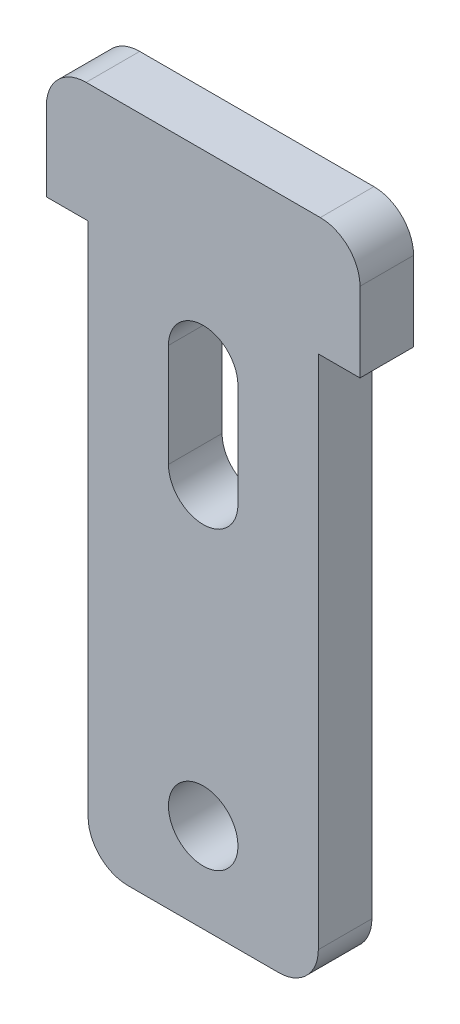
ISO-10303-21;
HEADER;
FILE_DESCRIPTION(('STEP AP214'),'2;1');
FILE_NAME('part.step','',(''),(''),'','','');
FILE_SCHEMA(('AUTOMOTIVE_DESIGN { 1 0 10303 214 1 1 1 1 }'));
ENDSEC;
DATA;
#1=APPLICATION_CONTEXT('core data for automotive mechanical design processes');
#2=APPLICATION_PROTOCOL_DEFINITION('international standard','automotive_design',2000,#1);
#3=PRODUCT_CONTEXT('',#1,'mechanical');
#4=PRODUCT('Part','Part','',(#3));
#5=PRODUCT_RELATED_PRODUCT_CATEGORY('part','',(#4));
#6=PRODUCT_DEFINITION_FORMATION('','',#4);
#7=PRODUCT_DEFINITION_CONTEXT('part definition',#1,'design');
#8=PRODUCT_DEFINITION('design','',#6,#7);
#9=PRODUCT_DEFINITION_SHAPE('','',#8);
#10=(LENGTH_UNIT() NAMED_UNIT(*) SI_UNIT(.MILLI.,.METRE.));
#11=(NAMED_UNIT(*) PLANE_ANGLE_UNIT() SI_UNIT($,.RADIAN.));
#12=(NAMED_UNIT(*) SI_UNIT($,.STERADIAN.) SOLID_ANGLE_UNIT());
#13=UNCERTAINTY_MEASURE_WITH_UNIT(LENGTH_MEASURE(1.E-05),#10,'distance_accuracy_value','');
#14=(GEOMETRIC_REPRESENTATION_CONTEXT(3) GLOBAL_UNCERTAINTY_ASSIGNED_CONTEXT((#13)) GLOBAL_UNIT_ASSIGNED_CONTEXT((#10,
#11,#12)) REPRESENTATION_CONTEXT('',''));
#15=CARTESIAN_POINT('',(0.,0.,0.));
#16=DIRECTION('',(0.,0.,1.));
#17=DIRECTION('',(1.,0.,0.));
#18=AXIS2_PLACEMENT_3D('',#15,#16,#17);
#19=CARTESIAN_POINT('',(5.9,4.,2.7));
#20=DIRECTION('',(0.,0.,-1.));
#21=DIRECTION('',(-1.,0.,0.));
#22=AXIS2_PLACEMENT_3D('',#19,#20,#21);
#23=PLANE('',#22);
#24=CARTESIAN_POINT('',(0.,-23.5,2.7));
#25=DIRECTION('',(0.,0.,1.));
#26=DIRECTION('',(1.,0.,0.));
#27=AXIS2_PLACEMENT_3D('',#24,#25,#26);
#28=CIRCLE('',#27,1.75);
#29=CARTESIAN_POINT('',(-1.75,-23.5,2.7));
#30=VERTEX_POINT('',#29);
#31=EDGE_CURVE('E194',#30,#30,#28,.T.);
#32=ORIENTED_EDGE('',*,*,#31,.F.);
#33=EDGE_LOOP('',(#32));
#34=FACE_BOUND('',#33,.T.);
#35=DIRECTION('',(1.,0.,0.));
#36=VECTOR('',#35,1.);
#37=CARTESIAN_POINT('',(5.8,0.,2.7));
#38=LINE('',#37,#36);
#39=CARTESIAN_POINT('',(5.8,0.,2.7));
#40=VERTEX_POINT('',#39);
#41=CARTESIAN_POINT('',(7.9,0.,2.7));
#42=VERTEX_POINT('',#41);
#43=EDGE_CURVE('E200',#40,#42,#38,.T.);
#44=ORIENTED_EDGE('',*,*,#43,.T.);
#45=DIRECTION('',(0.,1.,0.));
#46=VECTOR('',#45,1.);
#47=CARTESIAN_POINT('',(7.9,0.,2.7));
#48=LINE('',#47,#46);
#49=CARTESIAN_POINT('',(7.9,3.99999999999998,2.7));
#50=VERTEX_POINT('',#49);
#51=EDGE_CURVE('E203',#42,#50,#48,.T.);
#52=ORIENTED_EDGE('',*,*,#51,.T.);
#53=CARTESIAN_POINT('',(5.9,4.,2.7));
#54=DIRECTION('',(0.,0.,1.));
#55=DIRECTION('',(-1.,0.,0.));
#56=AXIS2_PLACEMENT_3D('',#53,#54,#55);
#57=CIRCLE('',#56,2.);
#58=CARTESIAN_POINT('',(5.89999999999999,6.,2.7));
#59=VERTEX_POINT('',#58);
#60=EDGE_CURVE('E206',#50,#59,#57,.T.);
#61=ORIENTED_EDGE('',*,*,#60,.T.);
#62=DIRECTION('',(-1.,0.,0.));
#63=VECTOR('',#62,1.);
#64=CARTESIAN_POINT('',(-5.89999999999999,6.,2.7));
#65=LINE('',#64,#63);
#66=CARTESIAN_POINT('',(-5.89999999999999,6.,2.7));
#67=VERTEX_POINT('',#66);
#68=EDGE_CURVE('E208',#59,#67,#65,.T.);
#69=ORIENTED_EDGE('',*,*,#68,.T.);
#70=CARTESIAN_POINT('',(-5.9,4.,2.7));
#71=DIRECTION('',(0.,0.,1.));
#72=DIRECTION('',(-1.,0.,0.));
#73=AXIS2_PLACEMENT_3D('',#70,#71,#72);
#74=CIRCLE('',#73,2.);
#75=CARTESIAN_POINT('',(-7.9,3.99999999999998,2.7));
#76=VERTEX_POINT('',#75);
#77=EDGE_CURVE('E210',#67,#76,#74,.T.);
#78=ORIENTED_EDGE('',*,*,#77,.T.);
#79=DIRECTION('',(0.,-1.,0.));
#80=VECTOR('',#79,1.);
#81=CARTESIAN_POINT('',(-7.9,0.,2.7));
#82=LINE('',#81,#80);
#83=CARTESIAN_POINT('',(-7.9,0.,2.7));
#84=VERTEX_POINT('',#83);
#85=EDGE_CURVE('E212',#76,#84,#82,.T.);
#86=ORIENTED_EDGE('',*,*,#85,.T.);
#87=DIRECTION('',(1.,0.,0.));
#88=VECTOR('',#87,1.);
#89=CARTESIAN_POINT('',(-7.9,0.,2.7));
#90=LINE('',#89,#88);
#91=CARTESIAN_POINT('',(-5.8,0.,2.7));
#92=VERTEX_POINT('',#91);
#93=EDGE_CURVE('E214',#84,#92,#90,.T.);
#94=ORIENTED_EDGE('',*,*,#93,.T.);
#95=DIRECTION('',(0.,-1.,0.));
#96=VECTOR('',#95,1.);
#97=CARTESIAN_POINT('',(-5.8,0.,2.7));
#98=LINE('',#97,#96);
#99=CARTESIAN_POINT('',(-5.8,-26.,2.7));
#100=VERTEX_POINT('',#99);
#101=EDGE_CURVE('E216',#92,#100,#98,.T.);
#102=ORIENTED_EDGE('',*,*,#101,.T.);
#103=CARTESIAN_POINT('',(-3.8,-26.,2.7));
#104=DIRECTION('',(0.,0.,1.));
#105=DIRECTION('',(1.,0.,0.));
#106=AXIS2_PLACEMENT_3D('',#103,#104,#105);
#107=CIRCLE('',#106,2.);
#108=CARTESIAN_POINT('',(-3.79999999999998,-28.,2.7));
#109=VERTEX_POINT('',#108);
#110=EDGE_CURVE('E218',#100,#109,#107,.T.);
#111=ORIENTED_EDGE('',*,*,#110,.T.);
#112=DIRECTION('',(1.,0.,0.));
#113=VECTOR('',#112,1.);
#114=CARTESIAN_POINT('',(-3.79999999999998,-28.,2.7));
#115=LINE('',#114,#113);
#116=CARTESIAN_POINT('',(3.79999999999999,-28.,2.7));
#117=VERTEX_POINT('',#116);
#118=EDGE_CURVE('E220',#109,#117,#115,.T.);
#119=ORIENTED_EDGE('',*,*,#118,.T.);
#120=CARTESIAN_POINT('',(3.8,-26.,2.7));
#121=DIRECTION('',(0.,0.,1.));
#122=DIRECTION('',(1.,0.,0.));
#123=AXIS2_PLACEMENT_3D('',#120,#121,#122);
#124=CIRCLE('',#123,2.);
#125=CARTESIAN_POINT('',(5.8,-26.,2.7));
#126=VERTEX_POINT('',#125);
#127=EDGE_CURVE('E222',#117,#126,#124,.T.);
#128=ORIENTED_EDGE('',*,*,#127,.T.);
#129=DIRECTION('',(0.,1.,0.));
#130=VECTOR('',#129,1.);
#131=CARTESIAN_POINT('',(5.8,-26.,2.7));
#132=LINE('',#131,#130);
#133=EDGE_CURVE('E224',#126,#40,#132,.T.);
#134=ORIENTED_EDGE('',*,*,#133,.T.);
#135=EDGE_LOOP('',(#44,#52,#61,#69,#78,#86,#94,#102,#111,#119,#128,#134));
#136=FACE_BOUND('',#135,.T.);
#137=CARTESIAN_POINT('',(0.,-3.40288885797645,2.7));
#138=DIRECTION('',(0.,0.,1.));
#139=DIRECTION('',(1.,0.,0.));
#140=AXIS2_PLACEMENT_3D('',#137,#138,#139);
#141=CIRCLE('',#140,1.75);
#142=CARTESIAN_POINT('',(1.75,-3.40288885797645,2.7));
#143=VERTEX_POINT('',#142);
#144=CARTESIAN_POINT('',(-1.75,-3.40288885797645,2.7));
#145=VERTEX_POINT('',#144);
#146=EDGE_CURVE('E158',#143,#145,#141,.T.);
#147=ORIENTED_EDGE('',*,*,#146,.F.);
#148=DIRECTION('',(0.,1.,0.));
#149=VECTOR('',#148,1.);
#150=CARTESIAN_POINT('',(1.75,-3.40288885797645,2.7));
#151=LINE('',#150,#149);
#152=CARTESIAN_POINT('',(1.75,-8.59711114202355,2.7));
#153=VERTEX_POINT('',#152);
#154=EDGE_CURVE('E180',#153,#143,#151,.T.);
#155=ORIENTED_EDGE('',*,*,#154,.F.);
#156=CARTESIAN_POINT('',(0.,-8.59711114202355,2.7));
#157=DIRECTION('',(0.,0.,1.));
#158=DIRECTION('',(1.,0.,0.));
#159=AXIS2_PLACEMENT_3D('',#156,#157,#158);
#160=CIRCLE('',#159,1.75);
#161=CARTESIAN_POINT('',(-1.75,-8.59711114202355,2.7));
#162=VERTEX_POINT('',#161);
#163=EDGE_CURVE('E178',#162,#153,#160,.T.);
#164=ORIENTED_EDGE('',*,*,#163,.F.);
#165=DIRECTION('',(0.,-1.,0.));
#166=VECTOR('',#165,1.);
#167=CARTESIAN_POINT('',(-1.75,-3.40288885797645,2.7));
#168=LINE('',#167,#166);
#169=EDGE_CURVE('E166',#145,#162,#168,.T.);
#170=ORIENTED_EDGE('',*,*,#169,.F.);
#171=EDGE_LOOP('',(#147,#155,#164,#170));
#172=FACE_BOUND('',#171,.T.);
#173=ADVANCED_FACE('F45',(#34,#136,#172),#23,.F.);
#174=CARTESIAN_POINT('',(5.9,4.,0.));
#175=DIRECTION('',(0.,0.,-1.));
#176=DIRECTION('',(-1.,0.,0.));
#177=AXIS2_PLACEMENT_3D('',#174,#175,#176);
#178=PLANE('',#177);
#179=DIRECTION('',(1.,0.,0.));
#180=VECTOR('',#179,1.);
#181=CARTESIAN_POINT('',(5.8,0.,0.));
#182=LINE('',#181,#180);
#183=CARTESIAN_POINT('',(5.8,0.,0.));
#184=VERTEX_POINT('',#183);
#185=CARTESIAN_POINT('',(7.9,0.,0.));
#186=VERTEX_POINT('',#185);
#187=EDGE_CURVE('E197',#184,#186,#182,.T.);
#188=ORIENTED_EDGE('',*,*,#187,.F.);
#189=DIRECTION('',(0.,1.,0.));
#190=VECTOR('',#189,1.);
#191=CARTESIAN_POINT('',(5.8,-26.,0.));
#192=LINE('',#191,#190);
#193=CARTESIAN_POINT('',(5.8,-26.,0.));
#194=VERTEX_POINT('',#193);
#195=EDGE_CURVE('E204',#194,#184,#192,.T.);
#196=ORIENTED_EDGE('',*,*,#195,.F.);
#197=CARTESIAN_POINT('',(3.8,-26.,0.));
#198=DIRECTION('',(0.,0.,1.));
#199=DIRECTION('',(1.,0.,0.));
#200=AXIS2_PLACEMENT_3D('',#197,#198,#199);
#201=CIRCLE('',#200,2.);
#202=CARTESIAN_POINT('',(3.79999999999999,-28.,0.));
#203=VERTEX_POINT('',#202);
#204=EDGE_CURVE('E247',#203,#194,#201,.T.);
#205=ORIENTED_EDGE('',*,*,#204,.F.);
#206=DIRECTION('',(1.,0.,0.));
#207=VECTOR('',#206,1.);
#208=CARTESIAN_POINT('',(-3.79999999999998,-28.,0.));
#209=LINE('',#208,#207);
#210=CARTESIAN_POINT('',(-3.79999999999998,-28.,0.));
#211=VERTEX_POINT('',#210);
#212=EDGE_CURVE('E245',#211,#203,#209,.T.);
#213=ORIENTED_EDGE('',*,*,#212,.F.);
#214=CARTESIAN_POINT('',(-3.8,-26.,0.));
#215=DIRECTION('',(0.,0.,1.));
#216=DIRECTION('',(1.,0.,0.));
#217=AXIS2_PLACEMENT_3D('',#214,#215,#216);
#218=CIRCLE('',#217,2.);
#219=CARTESIAN_POINT('',(-5.8,-26.,0.));
#220=VERTEX_POINT('',#219);
#221=EDGE_CURVE('E243',#220,#211,#218,.T.);
#222=ORIENTED_EDGE('',*,*,#221,.F.);
#223=DIRECTION('',(0.,-1.,0.));
#224=VECTOR('',#223,1.);
#225=CARTESIAN_POINT('',(-5.8,0.,0.));
#226=LINE('',#225,#224);
#227=CARTESIAN_POINT('',(-5.8,0.,0.));
#228=VERTEX_POINT('',#227);
#229=EDGE_CURVE('E241',#228,#220,#226,.T.);
#230=ORIENTED_EDGE('',*,*,#229,.F.);
#231=DIRECTION('',(1.,0.,0.));
#232=VECTOR('',#231,1.);
#233=CARTESIAN_POINT('',(-7.9,0.,0.));
#234=LINE('',#233,#232);
#235=CARTESIAN_POINT('',(-7.9,0.,0.));
#236=VERTEX_POINT('',#235);
#237=EDGE_CURVE('E239',#236,#228,#234,.T.);
#238=ORIENTED_EDGE('',*,*,#237,.F.);
#239=DIRECTION('',(0.,-1.,0.));
#240=VECTOR('',#239,1.);
#241=CARTESIAN_POINT('',(-7.9,0.,0.));
#242=LINE('',#241,#240);
#243=CARTESIAN_POINT('',(-7.9,3.99999999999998,0.));
#244=VERTEX_POINT('',#243);
#245=EDGE_CURVE('E237',#244,#236,#242,.T.);
#246=ORIENTED_EDGE('',*,*,#245,.F.);
#247=CARTESIAN_POINT('',(-5.9,4.,0.));
#248=DIRECTION('',(0.,0.,1.));
#249=DIRECTION('',(-1.,0.,0.));
#250=AXIS2_PLACEMENT_3D('',#247,#248,#249);
#251=CIRCLE('',#250,2.);
#252=CARTESIAN_POINT('',(-5.89999999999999,6.,0.));
#253=VERTEX_POINT('',#252);
#254=EDGE_CURVE('E235',#253,#244,#251,.T.);
#255=ORIENTED_EDGE('',*,*,#254,.F.);
#256=DIRECTION('',(-1.,0.,0.));
#257=VECTOR('',#256,1.);
#258=CARTESIAN_POINT('',(-5.89999999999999,6.,0.));
#259=LINE('',#258,#257);
#260=CARTESIAN_POINT('',(5.89999999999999,6.,0.));
#261=VERTEX_POINT('',#260);
#262=EDGE_CURVE('E233',#261,#253,#259,.T.);
#263=ORIENTED_EDGE('',*,*,#262,.F.);
#264=CARTESIAN_POINT('',(5.9,4.,0.));
#265=DIRECTION('',(0.,0.,1.));
#266=DIRECTION('',(-1.,0.,0.));
#267=AXIS2_PLACEMENT_3D('',#264,#265,#266);
#268=CIRCLE('',#267,2.);
#269=CARTESIAN_POINT('',(7.9,3.99999999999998,0.));
#270=VERTEX_POINT('',#269);
#271=EDGE_CURVE('E231',#270,#261,#268,.T.);
#272=ORIENTED_EDGE('',*,*,#271,.F.);
#273=DIRECTION('',(0.,1.,0.));
#274=VECTOR('',#273,1.);
#275=CARTESIAN_POINT('',(7.9,0.,0.));
#276=LINE('',#275,#274);
#277=EDGE_CURVE('E229',#186,#270,#276,.T.);
#278=ORIENTED_EDGE('',*,*,#277,.F.);
#279=EDGE_LOOP('',(#188,#196,#205,#213,#222,#230,#238,#246,#255,#263,#272,#278));
#280=FACE_BOUND('',#279,.T.);
#281=CARTESIAN_POINT('',(0.,-23.5,0.));
#282=DIRECTION('',(0.,0.,1.));
#283=DIRECTION('',(1.,0.,0.));
#284=AXIS2_PLACEMENT_3D('',#281,#282,#283);
#285=CIRCLE('',#284,1.75);
#286=CARTESIAN_POINT('',(-1.75,-23.5,0.));
#287=VERTEX_POINT('',#286);
#288=EDGE_CURVE('E174',#287,#287,#285,.T.);
#289=ORIENTED_EDGE('',*,*,#288,.T.);
#290=EDGE_LOOP('',(#289));
#291=FACE_BOUND('',#290,.T.);
#292=DIRECTION('',(0.,1.,0.));
#293=VECTOR('',#292,1.);
#294=CARTESIAN_POINT('',(1.75,-3.40288885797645,0.));
#295=LINE('',#294,#293);
#296=CARTESIAN_POINT('',(1.75,-8.59711114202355,0.));
#297=VERTEX_POINT('',#296);
#298=CARTESIAN_POINT('',(1.75,-3.40288885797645,0.));
#299=VERTEX_POINT('',#298);
#300=EDGE_CURVE('E167',#297,#299,#295,.T.);
#301=ORIENTED_EDGE('',*,*,#300,.T.);
#302=CARTESIAN_POINT('',(0.,-3.40288885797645,0.));
#303=DIRECTION('',(0.,0.,1.));
#304=DIRECTION('',(1.,0.,0.));
#305=AXIS2_PLACEMENT_3D('',#302,#303,#304);
#306=CIRCLE('',#305,1.75);
#307=CARTESIAN_POINT('',(-1.75,-3.40288885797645,0.));
#308=VERTEX_POINT('',#307);
#309=EDGE_CURVE('E68',#299,#308,#306,.T.);
#310=ORIENTED_EDGE('',*,*,#309,.T.);
#311=DIRECTION('',(0.,-1.,0.));
#312=VECTOR('',#311,1.);
#313=CARTESIAN_POINT('',(-1.75,-3.40288885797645,0.));
#314=LINE('',#313,#312);
#315=CARTESIAN_POINT('',(-1.75,-8.59711114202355,0.));
#316=VERTEX_POINT('',#315);
#317=EDGE_CURVE('E173',#308,#316,#314,.T.);
#318=ORIENTED_EDGE('',*,*,#317,.T.);
#319=CARTESIAN_POINT('',(0.,-8.59711114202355,0.));
#320=DIRECTION('',(0.,0.,1.));
#321=DIRECTION('',(1.,0.,0.));
#322=AXIS2_PLACEMENT_3D('',#319,#320,#321);
#323=CIRCLE('',#322,1.75);
#324=EDGE_CURVE('E186',#316,#297,#323,.T.);
#325=ORIENTED_EDGE('',*,*,#324,.T.);
#326=EDGE_LOOP('',(#301,#310,#318,#325));
#327=FACE_BOUND('',#326,.T.);
#328=ADVANCED_FACE('F289',(#280,#291,#327),#178,.T.);
#329=CARTESIAN_POINT('',(5.8,0.,2.7));
#330=DIRECTION('',(0.,1.,0.));
#331=DIRECTION('',(-1.,0.,0.));
#332=AXIS2_PLACEMENT_3D('',#329,#330,#331);
#333=PLANE('',#332);
#334=ORIENTED_EDGE('',*,*,#187,.T.);
#335=DIRECTION('',(0.,0.,-1.));
#336=VECTOR('',#335,1.);
#337=CARTESIAN_POINT('',(7.9,0.,2.7));
#338=LINE('',#337,#336);
#339=EDGE_CURVE('E13',#42,#186,#338,.T.);
#340=ORIENTED_EDGE('',*,*,#339,.F.);
#341=ORIENTED_EDGE('',*,*,#43,.F.);
#342=DIRECTION('',(0.,0.,-1.));
#343=VECTOR('',#342,1.);
#344=CARTESIAN_POINT('',(5.8,0.,2.7));
#345=LINE('',#344,#343);
#346=EDGE_CURVE('E226',#40,#184,#345,.T.);
#347=ORIENTED_EDGE('',*,*,#346,.T.);
#348=EDGE_LOOP('',(#334,#340,#341,#347));
#349=FACE_BOUND('',#348,.T.);
#350=ADVANCED_FACE('F47',(#349),#333,.F.);
#351=CARTESIAN_POINT('',(7.9,0.,2.7));
#352=DIRECTION('',(-1.,0.,0.));
#353=DIRECTION('',(0.,0.,1.));
#354=AXIS2_PLACEMENT_3D('',#351,#352,#353);
#355=PLANE('',#354);
#356=ORIENTED_EDGE('',*,*,#277,.T.);
#357=DIRECTION('',(0.,0.,-1.));
#358=VECTOR('',#357,1.);
#359=CARTESIAN_POINT('',(7.9,3.99999999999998,2.7));
#360=LINE('',#359,#358);
#361=EDGE_CURVE('E53',#50,#270,#360,.T.);
#362=ORIENTED_EDGE('',*,*,#361,.F.);
#363=ORIENTED_EDGE('',*,*,#51,.F.);
#364=ORIENTED_EDGE('',*,*,#339,.T.);
#365=EDGE_LOOP('',(#356,#362,#363,#364));
#366=FACE_BOUND('',#365,.T.);
#367=ADVANCED_FACE('F306',(#366),#355,.F.);
#368=CARTESIAN_POINT('',(5.9,4.,2.7));
#369=DIRECTION('',(0.,0.,-1.));
#370=DIRECTION('',(-1.,0.,0.));
#371=AXIS2_PLACEMENT_3D('',#368,#369,#370);
#372=CYLINDRICAL_SURFACE('',#371,2.);
#373=ORIENTED_EDGE('',*,*,#271,.T.);
#374=DIRECTION('',(0.,0.,-1.));
#375=VECTOR('',#374,1.);
#376=CARTESIAN_POINT('',(5.89999999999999,6.,2.7));
#377=LINE('',#376,#375);
#378=EDGE_CURVE('E276',#59,#261,#377,.T.);
#379=ORIENTED_EDGE('',*,*,#378,.F.);
#380=ORIENTED_EDGE('',*,*,#60,.F.);
#381=ORIENTED_EDGE('',*,*,#361,.T.);
#382=EDGE_LOOP('',(#373,#379,#380,#381));
#383=FACE_BOUND('',#382,.T.);
#384=ADVANCED_FACE('F283',(#383),#372,.T.);
#385=CARTESIAN_POINT('',(-5.89999999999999,6.,2.7));
#386=DIRECTION('',(0.,-1.,0.));
#387=DIRECTION('',(0.,0.,-1.));
#388=AXIS2_PLACEMENT_3D('',#385,#386,#387);
#389=PLANE('',#388);
#390=ORIENTED_EDGE('',*,*,#262,.T.);
#391=DIRECTION('',(0.,0.,-1.));
#392=VECTOR('',#391,1.);
#393=CARTESIAN_POINT('',(-5.89999999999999,6.,2.7));
#394=LINE('',#393,#392);
#395=EDGE_CURVE('E273',#67,#253,#394,.T.);
#396=ORIENTED_EDGE('',*,*,#395,.F.);
#397=ORIENTED_EDGE('',*,*,#68,.F.);
#398=ORIENTED_EDGE('',*,*,#378,.T.);
#399=EDGE_LOOP('',(#390,#396,#397,#398));
#400=FACE_BOUND('',#399,.T.);
#401=ADVANCED_FACE('F295',(#400),#389,.F.);
#402=CARTESIAN_POINT('',(-5.9,4.,2.7));
#403=DIRECTION('',(0.,0.,-1.));
#404=DIRECTION('',(-1.,0.,0.));
#405=AXIS2_PLACEMENT_3D('',#402,#403,#404);
#406=CYLINDRICAL_SURFACE('',#405,2.);
#407=ORIENTED_EDGE('',*,*,#254,.T.);
#408=DIRECTION('',(0.,0.,-1.));
#409=VECTOR('',#408,1.);
#410=CARTESIAN_POINT('',(-7.9,3.99999999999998,2.7));
#411=LINE('',#410,#409);
#412=EDGE_CURVE('E270',#76,#244,#411,.T.);
#413=ORIENTED_EDGE('',*,*,#412,.F.);
#414=ORIENTED_EDGE('',*,*,#77,.F.);
#415=ORIENTED_EDGE('',*,*,#395,.T.);
#416=EDGE_LOOP('',(#407,#413,#414,#415));
#417=FACE_BOUND('',#416,.T.);
#418=ADVANCED_FACE('F299',(#417),#406,.T.);
#419=CARTESIAN_POINT('',(-7.9,0.,2.7));
#420=DIRECTION('',(1.,0.,0.));
#421=DIRECTION('',(0.,0.,-1.));
#422=AXIS2_PLACEMENT_3D('',#419,#420,#421);
#423=PLANE('',#422);
#424=ORIENTED_EDGE('',*,*,#245,.T.);
#425=DIRECTION('',(0.,0.,-1.));
#426=VECTOR('',#425,1.);
#427=CARTESIAN_POINT('',(-7.9,0.,2.7));
#428=LINE('',#427,#426);
#429=EDGE_CURVE('E267',#84,#236,#428,.T.);
#430=ORIENTED_EDGE('',*,*,#429,.F.);
#431=ORIENTED_EDGE('',*,*,#85,.F.);
#432=ORIENTED_EDGE('',*,*,#412,.T.);
#433=EDGE_LOOP('',(#424,#430,#431,#432));
#434=FACE_BOUND('',#433,.T.);
#435=ADVANCED_FACE('F339',(#434),#423,.F.);
#436=CARTESIAN_POINT('',(-7.9,0.,2.7));
#437=DIRECTION('',(0.,1.,0.));
#438=DIRECTION('',(-1.,0.,0.));
#439=AXIS2_PLACEMENT_3D('',#436,#437,#438);
#440=PLANE('',#439);
#441=ORIENTED_EDGE('',*,*,#237,.T.);
#442=DIRECTION('',(0.,0.,-1.));
#443=VECTOR('',#442,1.);
#444=CARTESIAN_POINT('',(-5.8,0.,2.7));
#445=LINE('',#444,#443);
#446=EDGE_CURVE('E264',#92,#228,#445,.T.);
#447=ORIENTED_EDGE('',*,*,#446,.F.);
#448=ORIENTED_EDGE('',*,*,#93,.F.);
#449=ORIENTED_EDGE('',*,*,#429,.T.);
#450=EDGE_LOOP('',(#441,#447,#448,#449));
#451=FACE_BOUND('',#450,.T.);
#452=ADVANCED_FACE('F337',(#451),#440,.F.);
#453=CARTESIAN_POINT('',(-5.8,0.,2.7));
#454=DIRECTION('',(1.,0.,0.));
#455=DIRECTION('',(0.,1.,0.));
#456=AXIS2_PLACEMENT_3D('',#453,#454,#455);
#457=PLANE('',#456);
#458=ORIENTED_EDGE('',*,*,#229,.T.);
#459=DIRECTION('',(0.,0.,-1.));
#460=VECTOR('',#459,1.);
#461=CARTESIAN_POINT('',(-5.8,-26.,2.7));
#462=LINE('',#461,#460);
#463=EDGE_CURVE('E261',#100,#220,#462,.T.);
#464=ORIENTED_EDGE('',*,*,#463,.F.);
#465=ORIENTED_EDGE('',*,*,#101,.F.);
#466=ORIENTED_EDGE('',*,*,#446,.T.);
#467=EDGE_LOOP('',(#458,#464,#465,#466));
#468=FACE_BOUND('',#467,.T.);
#469=ADVANCED_FACE('F333',(#468),#457,.F.);
#470=CARTESIAN_POINT('',(-3.8,-26.,2.7));
#471=DIRECTION('',(0.,0.,-1.));
#472=DIRECTION('',(-1.,0.,0.));
#473=AXIS2_PLACEMENT_3D('',#470,#471,#472);
#474=CYLINDRICAL_SURFACE('',#473,2.);
#475=ORIENTED_EDGE('',*,*,#221,.T.);
#476=DIRECTION('',(0.,0.,-1.));
#477=VECTOR('',#476,1.);
#478=CARTESIAN_POINT('',(-3.79999999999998,-28.,2.7));
#479=LINE('',#478,#477);
#480=EDGE_CURVE('E258',#109,#211,#479,.T.);
#481=ORIENTED_EDGE('',*,*,#480,.F.);
#482=ORIENTED_EDGE('',*,*,#110,.F.);
#483=ORIENTED_EDGE('',*,*,#463,.T.);
#484=EDGE_LOOP('',(#475,#481,#482,#483));
#485=FACE_BOUND('',#484,.T.);
#486=ADVANCED_FACE('F328',(#485),#474,.T.);
#487=CARTESIAN_POINT('',(-3.79999999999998,-28.,2.7));
#488=DIRECTION('',(0.,1.,0.));
#489=DIRECTION('',(0.,0.,1.));
#490=AXIS2_PLACEMENT_3D('',#487,#488,#489);
#491=PLANE('',#490);
#492=ORIENTED_EDGE('',*,*,#212,.T.);
#493=DIRECTION('',(0.,0.,-1.));
#494=VECTOR('',#493,1.);
#495=CARTESIAN_POINT('',(3.79999999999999,-28.,2.7));
#496=LINE('',#495,#494);
#497=EDGE_CURVE('E255',#117,#203,#496,.T.);
#498=ORIENTED_EDGE('',*,*,#497,.F.);
#499=ORIENTED_EDGE('',*,*,#118,.F.);
#500=ORIENTED_EDGE('',*,*,#480,.T.);
#501=EDGE_LOOP('',(#492,#498,#499,#500));
#502=FACE_BOUND('',#501,.T.);
#503=ADVANCED_FACE('F322',(#502),#491,.F.);
#504=CARTESIAN_POINT('',(3.8,-26.,2.7));
#505=DIRECTION('',(0.,0.,-1.));
#506=DIRECTION('',(-1.,0.,0.));
#507=AXIS2_PLACEMENT_3D('',#504,#505,#506);
#508=CYLINDRICAL_SURFACE('',#507,2.);
#509=ORIENTED_EDGE('',*,*,#204,.T.);
#510=DIRECTION('',(0.,0.,-1.));
#511=VECTOR('',#510,1.);
#512=CARTESIAN_POINT('',(5.8,-26.,2.7));
#513=LINE('',#512,#511);
#514=EDGE_CURVE('E252',#126,#194,#513,.T.);
#515=ORIENTED_EDGE('',*,*,#514,.F.);
#516=ORIENTED_EDGE('',*,*,#127,.F.);
#517=ORIENTED_EDGE('',*,*,#497,.T.);
#518=EDGE_LOOP('',(#509,#515,#516,#517));
#519=FACE_BOUND('',#518,.T.);
#520=ADVANCED_FACE('F318',(#519),#508,.T.);
#521=CARTESIAN_POINT('',(5.8,-26.,2.7));
#522=DIRECTION('',(-1.,0.,0.));
#523=DIRECTION('',(0.,0.,1.));
#524=AXIS2_PLACEMENT_3D('',#521,#522,#523);
#525=PLANE('',#524);
#526=ORIENTED_EDGE('',*,*,#195,.T.);
#527=ORIENTED_EDGE('',*,*,#346,.F.);
#528=ORIENTED_EDGE('',*,*,#133,.F.);
#529=ORIENTED_EDGE('',*,*,#514,.T.);
#530=EDGE_LOOP('',(#526,#527,#528,#529));
#531=FACE_BOUND('',#530,.T.);
#532=ADVANCED_FACE('F313',(#531),#525,.F.);
#533=CARTESIAN_POINT('',(0.,-23.5,2.7));
#534=DIRECTION('',(0.,0.,-1.));
#535=DIRECTION('',(-1.,0.,0.));
#536=AXIS2_PLACEMENT_3D('',#533,#534,#535);
#537=CYLINDRICAL_SURFACE('',#536,1.75);
#538=CARTESIAN_POINT('',(-1.75,-23.5,2.7));
#539=CARTESIAN_POINT('',(-1.75,-23.5,2.671875));
#540=CARTESIAN_POINT('',(-1.75,-23.5,2.64375));
#541=CARTESIAN_POINT('',(-1.75,-23.5,2.5875));
#542=CARTESIAN_POINT('',(-1.75,-23.5,2.559375));
#543=CARTESIAN_POINT('',(-1.75,-23.5,2.503125));
#544=CARTESIAN_POINT('',(-1.75,-23.5,2.475));
#545=CARTESIAN_POINT('',(-1.75,-23.5,2.41875));
#546=CARTESIAN_POINT('',(-1.75,-23.5,2.390625));
#547=CARTESIAN_POINT('',(-1.75,-23.5,2.334375));
#548=CARTESIAN_POINT('',(-1.75,-23.5,2.30625));
#549=CARTESIAN_POINT('',(-1.75,-23.5,2.25));
#550=CARTESIAN_POINT('',(-1.75,-23.5,2.221875));
#551=CARTESIAN_POINT('',(-1.75,-23.5,2.165625));
#552=CARTESIAN_POINT('',(-1.75,-23.5,2.1375));
#553=CARTESIAN_POINT('',(-1.75,-23.5,2.08125));
#554=CARTESIAN_POINT('',(-1.75,-23.5,2.053125));
#555=CARTESIAN_POINT('',(-1.75,-23.5,1.996875));
#556=CARTESIAN_POINT('',(-1.75,-23.5,1.96875));
#557=CARTESIAN_POINT('',(-1.75,-23.5,1.9125));
#558=CARTESIAN_POINT('',(-1.75,-23.5,1.884375));
#559=CARTESIAN_POINT('',(-1.75,-23.5,1.828125));
#560=CARTESIAN_POINT('',(-1.75,-23.5,1.8));
#561=CARTESIAN_POINT('',(-1.75,-23.5,1.74375));
#562=CARTESIAN_POINT('',(-1.75,-23.5,1.715625));
#563=CARTESIAN_POINT('',(-1.75,-23.5,1.659375));
#564=CARTESIAN_POINT('',(-1.75,-23.5,1.63125));
#565=CARTESIAN_POINT('',(-1.75,-23.5,1.575));
#566=CARTESIAN_POINT('',(-1.75,-23.5,1.546875));
#567=CARTESIAN_POINT('',(-1.75,-23.5,1.490625));
#568=CARTESIAN_POINT('',(-1.75,-23.5,1.4625));
#569=CARTESIAN_POINT('',(-1.75,-23.5,1.40625));
#570=CARTESIAN_POINT('',(-1.75,-23.5,1.378125));
#571=CARTESIAN_POINT('',(-1.75,-23.5,1.321875));
#572=CARTESIAN_POINT('',(-1.75,-23.5,1.29375));
#573=CARTESIAN_POINT('',(-1.75,-23.5,1.2375));
#574=CARTESIAN_POINT('',(-1.75,-23.5,1.209375));
#575=CARTESIAN_POINT('',(-1.75,-23.5,1.153125));
#576=CARTESIAN_POINT('',(-1.75,-23.5,1.125));
#577=CARTESIAN_POINT('',(-1.75,-23.5,1.06875));
#578=CARTESIAN_POINT('',(-1.75,-23.5,1.040625));
#579=CARTESIAN_POINT('',(-1.75,-23.5,0.984375));
#580=CARTESIAN_POINT('',(-1.75,-23.5,0.956249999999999));
#581=CARTESIAN_POINT('',(-1.75,-23.5,0.899999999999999));
#582=CARTESIAN_POINT('',(-1.75,-23.5,0.871875));
#583=CARTESIAN_POINT('',(-1.75,-23.5,0.815624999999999));
#584=CARTESIAN_POINT('',(-1.75,-23.5,0.787499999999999));
#585=CARTESIAN_POINT('',(-1.75,-23.5,0.73125));
#586=CARTESIAN_POINT('',(-1.75,-23.5,0.703125));
#587=CARTESIAN_POINT('',(-1.75,-23.5,0.646875));
#588=CARTESIAN_POINT('',(-1.75,-23.5,0.61875));
#589=CARTESIAN_POINT('',(-1.75,-23.5,0.5625));
#590=CARTESIAN_POINT('',(-1.75,-23.5,0.534375));
#591=CARTESIAN_POINT('',(-1.75,-23.5,0.478125));
#592=CARTESIAN_POINT('',(-1.75,-23.5,0.45));
#593=CARTESIAN_POINT('',(-1.75,-23.5,0.39375));
#594=CARTESIAN_POINT('',(-1.75,-23.5,0.365625));
#595=CARTESIAN_POINT('',(-1.75,-23.5,0.309375));
#596=CARTESIAN_POINT('',(-1.75,-23.5,0.28125));
#597=CARTESIAN_POINT('',(-1.75,-23.5,0.225));
#598=CARTESIAN_POINT('',(-1.75,-23.5,0.196875));
#599=CARTESIAN_POINT('',(-1.75,-23.5,0.140625));
#600=CARTESIAN_POINT('',(-1.75,-23.5,0.1125));
#601=CARTESIAN_POINT('',(-1.75,-23.5,0.0562499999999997));
#602=CARTESIAN_POINT('',(-1.75,-23.5,0.0281249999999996));
#603=CARTESIAN_POINT('',(-1.75,-23.5,0.));
#604=B_SPLINE_CURVE_WITH_KNOTS('',3,(#538,#539,#540,#541,#542,#543,#544,#545,#546,#547,#548,
#549,#550,#551,#552,#553,#554,#555,#556,#557,#558,#559,#560,#561,#562,#563,#564,#565,#566,#567,
#568,#569,#570,#571,#572,#573,#574,#575,#576,#577,#578,#579,#580,#581,#582,#583,#584,#585,#586,
#587,#588,#589,#590,#591,#592,#593,#594,#595,#596,#597,#598,#599,#600,#601,#602,#603),
.UNSPECIFIED.,.F.,.F.,(4,2,2,2,2,2,2,2,2,2,2,2,2,2,2,2,2,2,2,2,2,2,2,2,2,2,2,2,2,2,2,2,4),(0.,
0.0843750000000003,0.16875,0.253125,0.3375,0.421875,0.50625,0.590625,0.675,0.759375,0.84375,
0.928125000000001,1.0125,1.096875,1.18125,1.265625,1.35,1.434375,1.51875,1.603125,1.6875,
1.771875,1.85625,1.940625,2.025,2.109375,2.19375,2.278125,2.3625,2.446875,2.53125,2.615625,2.7),.UNSPECIFIED.);
#605=EDGE_CURVE('BSEAM357',#30,#287,#604,.T.);
#606=ORIENTED_EDGE('',*,*,#31,.T.);
#607=ORIENTED_EDGE('',*,*,#288,.F.);
#608=ORIENTED_EDGE('',*,*,#605,.T.);
#609=ORIENTED_EDGE('',*,*,#605,.F.);
#610=EDGE_LOOP('',(#606,#608,#607,#609));
#611=FACE_BOUND('',#610,.T.);
#612=ADVANCED_FACE('F357',(#611),#537,.F.);
#613=CARTESIAN_POINT('',(0.,-3.40288885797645,2.7));
#614=DIRECTION('',(0.,0.,-1.));
#615=DIRECTION('',(-1.,0.,0.));
#616=AXIS2_PLACEMENT_3D('',#613,#614,#615);
#617=CYLINDRICAL_SURFACE('',#616,1.75);
#618=ORIENTED_EDGE('',*,*,#309,.F.);
#619=DIRECTION('',(0.,0.,-1.));
#620=VECTOR('',#619,1.);
#621=CARTESIAN_POINT('',(1.75,-3.40288885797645,2.7));
#622=LINE('',#621,#620);
#623=EDGE_CURVE('E162',#143,#299,#622,.T.);
#624=ORIENTED_EDGE('',*,*,#623,.F.);
#625=ORIENTED_EDGE('',*,*,#146,.T.);
#626=DIRECTION('',(0.,0.,-1.));
#627=VECTOR('',#626,1.);
#628=CARTESIAN_POINT('',(-1.75,-3.40288885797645,2.7));
#629=LINE('',#628,#627);
#630=EDGE_CURVE('E161',#145,#308,#629,.T.);
#631=ORIENTED_EDGE('',*,*,#630,.T.);
#632=EDGE_LOOP('',(#618,#624,#625,#631));
#633=FACE_BOUND('',#632,.T.);
#634=ADVANCED_FACE('F160',(#633),#617,.F.);
#635=CARTESIAN_POINT('',(-1.75,-3.40288885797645,2.7));
#636=DIRECTION('',(1.,0.,0.));
#637=DIRECTION('',(0.,1.,0.));
#638=AXIS2_PLACEMENT_3D('',#635,#636,#637);
#639=PLANE('',#638);
#640=ORIENTED_EDGE('',*,*,#317,.F.);
#641=ORIENTED_EDGE('',*,*,#630,.F.);
#642=ORIENTED_EDGE('',*,*,#169,.T.);
#643=DIRECTION('',(0.,0.,-1.));
#644=VECTOR('',#643,1.);
#645=CARTESIAN_POINT('',(-1.75,-8.59711114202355,2.7));
#646=LINE('',#645,#644);
#647=EDGE_CURVE('E175',#162,#316,#646,.T.);
#648=ORIENTED_EDGE('',*,*,#647,.T.);
#649=EDGE_LOOP('',(#640,#641,#642,#648));
#650=FACE_BOUND('',#649,.T.);
#651=ADVANCED_FACE('F170',(#650),#639,.T.);
#652=CARTESIAN_POINT('',(0.,-8.59711114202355,2.7));
#653=DIRECTION('',(0.,0.,-1.));
#654=DIRECTION('',(-1.,0.,0.));
#655=AXIS2_PLACEMENT_3D('',#652,#653,#654);
#656=CYLINDRICAL_SURFACE('',#655,1.75);
#657=ORIENTED_EDGE('',*,*,#324,.F.);
#658=ORIENTED_EDGE('',*,*,#647,.F.);
#659=ORIENTED_EDGE('',*,*,#163,.T.);
#660=DIRECTION('',(0.,0.,-1.));
#661=VECTOR('',#660,1.);
#662=CARTESIAN_POINT('',(1.75,-8.59711114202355,2.7));
#663=LINE('',#662,#661);
#664=EDGE_CURVE('E60',#153,#297,#663,.T.);
#665=ORIENTED_EDGE('',*,*,#664,.T.);
#666=EDGE_LOOP('',(#657,#658,#659,#665));
#667=FACE_BOUND('',#666,.T.);
#668=ADVANCED_FACE('F406',(#667),#656,.F.);
#669=CARTESIAN_POINT('',(1.75,-3.40288885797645,2.7));
#670=DIRECTION('',(-1.,0.,0.));
#671=DIRECTION('',(0.,-1.,0.));
#672=AXIS2_PLACEMENT_3D('',#669,#670,#671);
#673=PLANE('',#672);
#674=ORIENTED_EDGE('',*,*,#300,.F.);
#675=ORIENTED_EDGE('',*,*,#664,.F.);
#676=ORIENTED_EDGE('',*,*,#154,.T.);
#677=ORIENTED_EDGE('',*,*,#623,.T.);
#678=EDGE_LOOP('',(#674,#675,#676,#677));
#679=FACE_BOUND('',#678,.T.);
#680=ADVANCED_FACE('F413',(#679),#673,.T.);
#681=CLOSED_SHELL('',(#173,#328,#350,#367,#384,#401,#418,#435,#452,#469,#486,#503,#520,#532,
#612,#634,#651,#668,#680));
#682=MANIFOLD_SOLID_BREP('B2',#681);
#683=ADVANCED_BREP_SHAPE_REPRESENTATION('',(#18,#682),#14);
#684=SHAPE_DEFINITION_REPRESENTATION(#9,#683);
ENDSEC;
END-ISO-10303-21;
